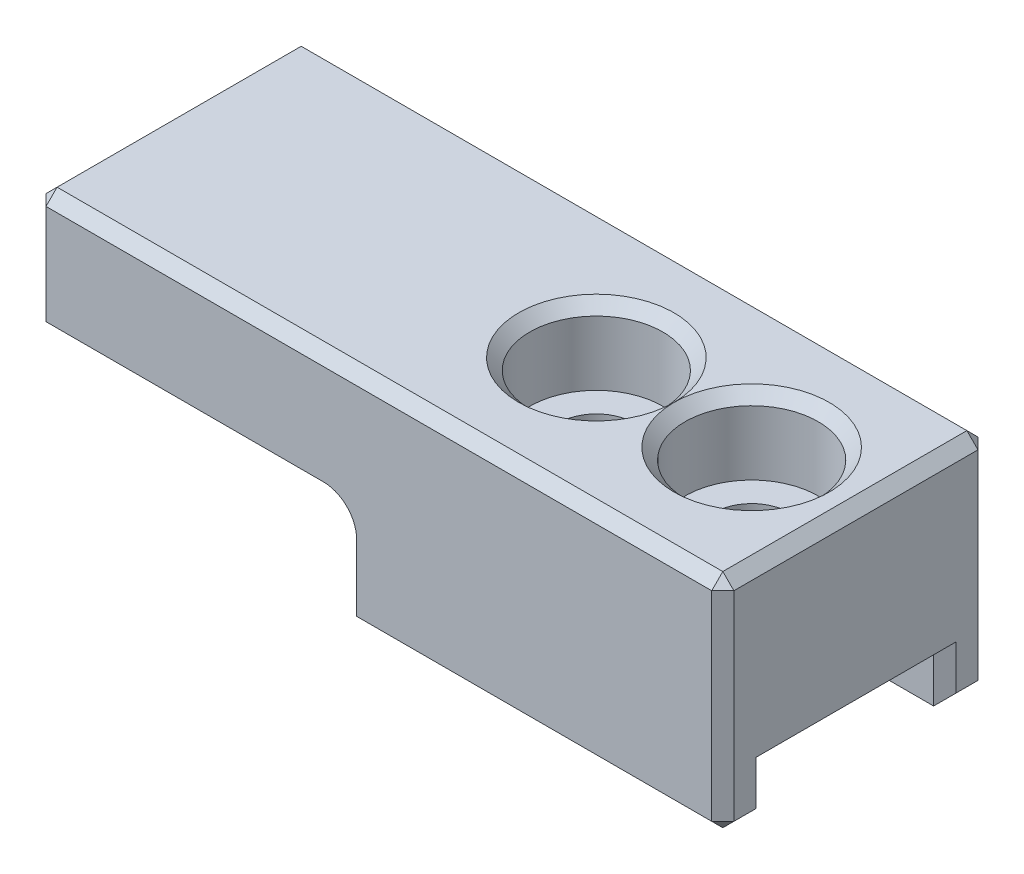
ISO-10303-21;
HEADER;
FILE_DESCRIPTION(('STEP AP214'),'2;1');
FILE_NAME('part.step','',(''),(''),'','','');
FILE_SCHEMA(('AUTOMOTIVE_DESIGN { 1 0 10303 214 1 1 1 1 }'));
ENDSEC;
DATA;
#1=APPLICATION_CONTEXT('core data for automotive mechanical design processes');
#2=APPLICATION_PROTOCOL_DEFINITION('international standard','automotive_design',2000,#1);
#3=PRODUCT_CONTEXT('',#1,'mechanical');
#4=PRODUCT('Part','Part','',(#3));
#5=PRODUCT_RELATED_PRODUCT_CATEGORY('part','',(#4));
#6=PRODUCT_DEFINITION_FORMATION('','',#4);
#7=PRODUCT_DEFINITION_CONTEXT('part definition',#1,'design');
#8=PRODUCT_DEFINITION('design','',#6,#7);
#9=PRODUCT_DEFINITION_SHAPE('','',#8);
#10=(LENGTH_UNIT() NAMED_UNIT(*) SI_UNIT(.MILLI.,.METRE.));
#11=(NAMED_UNIT(*) PLANE_ANGLE_UNIT() SI_UNIT($,.RADIAN.));
#12=(NAMED_UNIT(*) SI_UNIT($,.STERADIAN.) SOLID_ANGLE_UNIT());
#13=UNCERTAINTY_MEASURE_WITH_UNIT(LENGTH_MEASURE(1.E-05),#10,'distance_accuracy_value','');
#14=(GEOMETRIC_REPRESENTATION_CONTEXT(3) GLOBAL_UNCERTAINTY_ASSIGNED_CONTEXT((#13)) GLOBAL_UNIT_ASSIGNED_CONTEXT((#10,
#11,#12)) REPRESENTATION_CONTEXT('',''));
#15=CARTESIAN_POINT('',(0.,0.,0.));
#16=DIRECTION('',(0.,0.,1.));
#17=DIRECTION('',(1.,0.,0.));
#18=AXIS2_PLACEMENT_3D('',#15,#16,#17);
#19=CARTESIAN_POINT('',(-51.8,15.45,-12.));
#20=DIRECTION('',(0.,-1.,0.));
#21=DIRECTION('',(1.,0.,0.));
#22=AXIS2_PLACEMENT_3D('',#19,#20,#21);
#23=PLANE('',#22);
#24=DIRECTION('',(1.,0.,0.));
#25=VECTOR('',#24,1.);
#26=CARTESIAN_POINT('',(-51.8,15.45,-11.5));
#27=LINE('',#26,#25);
#28=CARTESIAN_POINT('',(-68.8,15.45,-11.5));
#29=VERTEX_POINT('',#28);
#30=CARTESIAN_POINT('',(-52.3,15.45,-11.5));
#31=VERTEX_POINT('',#30);
#32=EDGE_CURVE('E276',#29,#31,#27,.T.);
#33=ORIENTED_EDGE('',*,*,#32,.T.);
#34=DIRECTION('',(0.,0.,1.));
#35=VECTOR('',#34,1.);
#36=CARTESIAN_POINT('',(-52.3,15.45,-12.));
#37=LINE('',#36,#35);
#38=CARTESIAN_POINT('',(-52.3,15.45,-10.));
#39=VERTEX_POINT('',#38);
#40=EDGE_CURVE('E278',#31,#39,#37,.T.);
#41=ORIENTED_EDGE('',*,*,#40,.T.);
#42=DIRECTION('',(1.,0.,0.));
#43=VECTOR('',#42,1.);
#44=CARTESIAN_POINT('',(-82.8,15.45,-10.));
#45=LINE('',#44,#43);
#46=CARTESIAN_POINT('',(-68.8,15.45,-10.));
#47=VERTEX_POINT('',#46);
#48=EDGE_CURVE('E439',#47,#39,#45,.T.);
#49=ORIENTED_EDGE('',*,*,#48,.F.);
#50=DIRECTION('',(0.,0.,1.));
#51=VECTOR('',#50,1.);
#52=CARTESIAN_POINT('',(-68.8,15.45,-12.));
#53=LINE('',#52,#51);
#54=EDGE_CURVE('E199',#29,#47,#53,.T.);
#55=ORIENTED_EDGE('',*,*,#54,.F.);
#56=EDGE_LOOP('',(#33,#41,#49,#55));
#57=FACE_BOUND('',#56,.T.);
#58=ADVANCED_FACE('F16',(#57),#23,.T.);
#59=CARTESIAN_POINT('',(-51.8,15.45,-12.));
#60=DIRECTION('',(1.,0.,0.));
#61=DIRECTION('',(0.,0.,-1.));
#62=AXIS2_PLACEMENT_3D('',#59,#60,#61);
#63=PLANE('',#62);
#64=DIRECTION('',(0.,1.,0.));
#65=VECTOR('',#64,1.);
#66=CARTESIAN_POINT('',(-51.8,17.45,-1.5));
#67=LINE('',#66,#65);
#68=CARTESIAN_POINT('',(-51.8,15.95,-1.5));
#69=VERTEX_POINT('',#68);
#70=CARTESIAN_POINT('',(-51.8,17.95,-1.5));
#71=VERTEX_POINT('',#70);
#72=EDGE_CURVE('E264',#69,#71,#67,.T.);
#73=ORIENTED_EDGE('',*,*,#72,.T.);
#74=DIRECTION('',(0.,0.,-1.));
#75=VECTOR('',#74,1.);
#76=CARTESIAN_POINT('',(-51.8,17.95,-10.));
#77=LINE('',#76,#75);
#78=CARTESIAN_POINT('',(-51.8,17.95,-10.5));
#79=VERTEX_POINT('',#78);
#80=EDGE_CURVE('E266',#71,#79,#77,.T.);
#81=ORIENTED_EDGE('',*,*,#80,.T.);
#82=DIRECTION('',(0.,-1.,0.));
#83=VECTOR('',#82,1.);
#84=CARTESIAN_POINT('',(-51.8,15.45,-10.5));
#85=LINE('',#84,#83);
#86=CARTESIAN_POINT('',(-51.8,15.95,-10.5));
#87=VERTEX_POINT('',#86);
#88=EDGE_CURVE('E260',#79,#87,#85,.T.);
#89=ORIENTED_EDGE('',*,*,#88,.T.);
#90=DIRECTION('',(0.,0.,-1.));
#91=VECTOR('',#90,1.);
#92=CARTESIAN_POINT('',(-51.8,15.95,-12.));
#93=LINE('',#92,#91);
#94=CARTESIAN_POINT('',(-51.8,15.95,-11.5));
#95=VERTEX_POINT('',#94);
#96=EDGE_CURVE('E258',#87,#95,#93,.T.);
#97=ORIENTED_EDGE('',*,*,#96,.T.);
#98=DIRECTION('',(0.,1.,0.));
#99=VECTOR('',#98,1.);
#100=CARTESIAN_POINT('',(-51.8,15.45,-11.5));
#101=LINE('',#100,#99);
#102=CARTESIAN_POINT('',(-51.8,24.95,-11.5));
#103=VERTEX_POINT('',#102);
#104=EDGE_CURVE('E256',#95,#103,#101,.T.);
#105=ORIENTED_EDGE('',*,*,#104,.T.);
#106=DIRECTION('',(0.,0.,1.));
#107=VECTOR('',#106,1.);
#108=CARTESIAN_POINT('',(-51.8,24.95,-12.));
#109=LINE('',#108,#107);
#110=CARTESIAN_POINT('',(-51.8,24.95,-0.5));
#111=VERTEX_POINT('',#110);
#112=EDGE_CURVE('E252',#103,#111,#109,.T.);
#113=ORIENTED_EDGE('',*,*,#112,.T.);
#114=DIRECTION('',(0.,-1.,0.));
#115=VECTOR('',#114,1.);
#116=CARTESIAN_POINT('',(-51.8,15.45,-0.5));
#117=LINE('',#116,#115);
#118=CARTESIAN_POINT('',(-51.8,15.95,-0.5));
#119=VERTEX_POINT('',#118);
#120=EDGE_CURVE('E254',#111,#119,#117,.T.);
#121=ORIENTED_EDGE('',*,*,#120,.T.);
#122=DIRECTION('',(0.,0.,-1.));
#123=VECTOR('',#122,1.);
#124=CARTESIAN_POINT('',(-51.8,15.95,-12.));
#125=LINE('',#124,#123);
#126=EDGE_CURVE('E262',#119,#69,#125,.T.);
#127=ORIENTED_EDGE('',*,*,#126,.T.);
#128=EDGE_LOOP('',(#73,#81,#89,#97,#105,#113,#121,#127));
#129=FACE_BOUND('',#128,.T.);
#130=ADVANCED_FACE('F494',(#129),#63,.T.);
#131=DIRECTION('',(1.,0.,0.));
#132=VECTOR('',#131,1.);
#133=CARTESIAN_POINT('',(-82.8,15.45,-2.));
#134=LINE('',#133,#132);
#135=CARTESIAN_POINT('',(-68.8,15.45,-2.));
#136=VERTEX_POINT('',#135);
#137=CARTESIAN_POINT('',(-52.3,15.45,-2.));
#138=VERTEX_POINT('',#137);
#139=EDGE_CURVE('E442',#136,#138,#134,.T.);
#140=ORIENTED_EDGE('',*,*,#139,.T.);
#141=DIRECTION('',(0.,0.,1.));
#142=VECTOR('',#141,1.);
#143=CARTESIAN_POINT('',(-52.3,15.45,-12.));
#144=LINE('',#143,#142);
#145=CARTESIAN_POINT('',(-52.3,15.45,-0.5));
#146=VERTEX_POINT('',#145);
#147=EDGE_CURVE('E273',#138,#146,#144,.T.);
#148=ORIENTED_EDGE('',*,*,#147,.T.);
#149=DIRECTION('',(-1.,0.,0.));
#150=VECTOR('',#149,1.);
#151=CARTESIAN_POINT('',(-68.8,15.45,-0.5));
#152=LINE('',#151,#150);
#153=CARTESIAN_POINT('',(-68.8,15.45,-0.5));
#154=VERTEX_POINT('',#153);
#155=EDGE_CURVE('E271',#146,#154,#152,.T.);
#156=ORIENTED_EDGE('',*,*,#155,.T.);
#157=EDGE_CURVE('E447',#136,#154,#53,.T.);
#158=ORIENTED_EDGE('',*,*,#157,.F.);
#159=EDGE_LOOP('',(#140,#148,#156,#158));
#160=FACE_BOUND('',#159,.T.);
#161=ADVANCED_FACE('F535',(#160),#23,.T.);
#162=CARTESIAN_POINT('',(-68.8,15.45,-12.));
#163=DIRECTION('',(-1.,0.,0.));
#164=DIRECTION('',(0.,0.,1.));
#165=AXIS2_PLACEMENT_3D('',#162,#163,#164);
#166=PLANE('',#165);
#167=DIRECTION('',(0.,0.,1.));
#168=VECTOR('',#167,1.);
#169=CARTESIAN_POINT('',(-68.8,18.95,-12.));
#170=LINE('',#169,#168);
#171=CARTESIAN_POINT('',(-68.8,18.95,-11.5));
#172=VERTEX_POINT('',#171);
#173=CARTESIAN_POINT('',(-68.8,18.95,-0.5));
#174=VERTEX_POINT('',#173);
#175=EDGE_CURVE('E448',#172,#174,#170,.T.);
#176=ORIENTED_EDGE('',*,*,#175,.F.);
#177=DIRECTION('',(0.,-1.,0.));
#178=VECTOR('',#177,1.);
#179=CARTESIAN_POINT('',(-68.8,15.45,-11.5));
#180=LINE('',#179,#178);
#181=EDGE_CURVE('E316',#172,#29,#180,.T.);
#182=ORIENTED_EDGE('',*,*,#181,.T.);
#183=ORIENTED_EDGE('',*,*,#54,.T.);
#184=DIRECTION('',(0.,-1.,0.));
#185=VECTOR('',#184,1.);
#186=CARTESIAN_POINT('',(-68.8,15.45,-10.));
#187=LINE('',#186,#185);
#188=CARTESIAN_POINT('',(-68.8,17.45,-10.));
#189=VERTEX_POINT('',#188);
#190=EDGE_CURVE('E205',#189,#47,#187,.T.);
#191=ORIENTED_EDGE('',*,*,#190,.F.);
#192=DIRECTION('',(0.,0.,-1.));
#193=VECTOR('',#192,1.);
#194=CARTESIAN_POINT('',(-68.8,17.45,-12.));
#195=LINE('',#194,#193);
#196=CARTESIAN_POINT('',(-68.8,17.45,-2.));
#197=VERTEX_POINT('',#196);
#198=EDGE_CURVE('E186',#197,#189,#195,.T.);
#199=ORIENTED_EDGE('',*,*,#198,.F.);
#200=DIRECTION('',(0.,1.,0.));
#201=VECTOR('',#200,1.);
#202=CARTESIAN_POINT('',(-68.8,15.45,-2.));
#203=LINE('',#202,#201);
#204=EDGE_CURVE('E198',#136,#197,#203,.T.);
#205=ORIENTED_EDGE('',*,*,#204,.F.);
#206=ORIENTED_EDGE('',*,*,#157,.T.);
#207=DIRECTION('',(0.,1.,0.));
#208=VECTOR('',#207,1.);
#209=CARTESIAN_POINT('',(-68.8,18.95,-0.5));
#210=LINE('',#209,#208);
#211=EDGE_CURVE('E314',#154,#174,#210,.T.);
#212=ORIENTED_EDGE('',*,*,#211,.T.);
#213=EDGE_LOOP('',(#176,#182,#183,#191,#199,#205,#206,#212));
#214=FACE_BOUND('',#213,.T.);
#215=ADVANCED_FACE('F212',(#214),#166,.T.);
#216=CARTESIAN_POINT('',(-69.8,18.95,-12.));
#217=DIRECTION('',(0.,0.,1.));
#218=DIRECTION('',(1.,0.,0.));
#219=AXIS2_PLACEMENT_3D('',#216,#217,#218);
#220=CYLINDRICAL_SURFACE('',#219,1.);
#221=DIRECTION('',(0.,0.,1.));
#222=VECTOR('',#221,1.);
#223=CARTESIAN_POINT('',(-69.8,19.95,-12.));
#224=LINE('',#223,#222);
#225=CARTESIAN_POINT('',(-69.8,19.95,-11.5));
#226=VERTEX_POINT('',#225);
#227=CARTESIAN_POINT('',(-69.8,19.95,-0.5));
#228=VERTEX_POINT('',#227);
#229=EDGE_CURVE('E441',#226,#228,#224,.T.);
#230=ORIENTED_EDGE('',*,*,#229,.F.);
#231=CARTESIAN_POINT('',(-69.8,18.95,-11.5));
#232=DIRECTION('',(0.,0.,-1.));
#233=DIRECTION('',(-1.,0.,0.));
#234=AXIS2_PLACEMENT_3D('',#231,#232,#233);
#235=CIRCLE('',#234,1.);
#236=EDGE_CURVE('E312',#226,#172,#235,.T.);
#237=ORIENTED_EDGE('',*,*,#236,.T.);
#238=ORIENTED_EDGE('',*,*,#175,.T.);
#239=CARTESIAN_POINT('',(-69.8,18.95,-0.5));
#240=DIRECTION('',(0.,0.,-1.));
#241=DIRECTION('',(-1.,0.,0.));
#242=AXIS2_PLACEMENT_3D('',#239,#240,#241);
#243=CIRCLE('',#242,1.);
#244=EDGE_CURVE('E310',#174,#228,#243,.F.);
#245=ORIENTED_EDGE('',*,*,#244,.T.);
#246=EDGE_LOOP('',(#230,#237,#238,#245));
#247=FACE_BOUND('',#246,.T.);
#248=ADVANCED_FACE('F531',(#247),#220,.F.);
#249=CARTESIAN_POINT('',(-82.8,19.95,-12.));
#250=DIRECTION('',(0.,-1.,0.));
#251=DIRECTION('',(1.,0.,0.));
#252=AXIS2_PLACEMENT_3D('',#249,#250,#251);
#253=PLANE('',#252);
#254=DIRECTION('',(0.,0.,-1.));
#255=VECTOR('',#254,1.);
#256=CARTESIAN_POINT('',(-82.3,19.95,-12.));
#257=LINE('',#256,#255);
#258=CARTESIAN_POINT('',(-82.3,19.95,-0.5));
#259=VERTEX_POINT('',#258);
#260=CARTESIAN_POINT('',(-82.3,19.95,-11.5));
#261=VERTEX_POINT('',#260);
#262=EDGE_CURVE('E291',#259,#261,#257,.T.);
#263=ORIENTED_EDGE('',*,*,#262,.T.);
#264=DIRECTION('',(1.,0.,0.));
#265=VECTOR('',#264,1.);
#266=CARTESIAN_POINT('',(-82.8,19.95,-11.5));
#267=LINE('',#266,#265);
#268=EDGE_CURVE('E293',#261,#226,#267,.T.);
#269=ORIENTED_EDGE('',*,*,#268,.T.);
#270=ORIENTED_EDGE('',*,*,#229,.T.);
#271=DIRECTION('',(-1.,0.,0.));
#272=VECTOR('',#271,1.);
#273=CARTESIAN_POINT('',(-82.8,19.95,-0.5));
#274=LINE('',#273,#272);
#275=EDGE_CURVE('E289',#228,#259,#274,.T.);
#276=ORIENTED_EDGE('',*,*,#275,.T.);
#277=EDGE_LOOP('',(#263,#269,#270,#276));
#278=FACE_BOUND('',#277,.T.);
#279=ADVANCED_FACE('F455',(#278),#253,.T.);
#280=CARTESIAN_POINT('',(-82.8,19.95,-12.));
#281=DIRECTION('',(-1.,0.,0.));
#282=DIRECTION('',(0.,0.,1.));
#283=AXIS2_PLACEMENT_3D('',#280,#281,#282);
#284=PLANE('',#283);
#285=DIRECTION('',(0.,-1.,0.));
#286=VECTOR('',#285,1.);
#287=CARTESIAN_POINT('',(-82.8,19.95,-11.5));
#288=LINE('',#287,#286);
#289=CARTESIAN_POINT('',(-82.8,24.95,-11.5));
#290=VERTEX_POINT('',#289);
#291=CARTESIAN_POINT('',(-82.8,20.45,-11.5));
#292=VERTEX_POINT('',#291);
#293=EDGE_CURVE('E284',#290,#292,#288,.T.);
#294=ORIENTED_EDGE('',*,*,#293,.T.);
#295=DIRECTION('',(0.,0.,1.));
#296=VECTOR('',#295,1.);
#297=CARTESIAN_POINT('',(-82.8,20.45,-12.));
#298=LINE('',#297,#296);
#299=CARTESIAN_POINT('',(-82.8,20.45,-0.5));
#300=VERTEX_POINT('',#299);
#301=EDGE_CURVE('E286',#292,#300,#298,.T.);
#302=ORIENTED_EDGE('',*,*,#301,.T.);
#303=DIRECTION('',(0.,1.,0.));
#304=VECTOR('',#303,1.);
#305=CARTESIAN_POINT('',(-82.8,25.45,-0.5));
#306=LINE('',#305,#304);
#307=CARTESIAN_POINT('',(-82.8,24.95,-0.5));
#308=VERTEX_POINT('',#307);
#309=EDGE_CURVE('E282',#300,#308,#306,.T.);
#310=ORIENTED_EDGE('',*,*,#309,.T.);
#311=DIRECTION('',(0.,0.,-1.));
#312=VECTOR('',#311,1.);
#313=CARTESIAN_POINT('',(-82.8,24.95,-12.));
#314=LINE('',#313,#312);
#315=EDGE_CURVE('E280',#308,#290,#314,.T.);
#316=ORIENTED_EDGE('',*,*,#315,.T.);
#317=EDGE_LOOP('',(#294,#302,#310,#316));
#318=FACE_BOUND('',#317,.T.);
#319=ADVANCED_FACE('F603',(#318),#284,.T.);
#320=CARTESIAN_POINT('',(-51.8,25.45,-12.));
#321=DIRECTION('',(0.,1.,0.));
#322=DIRECTION('',(-1.,0.,0.));
#323=AXIS2_PLACEMENT_3D('',#320,#321,#322);
#324=PLANE('',#323);
#325=CARTESIAN_POINT('',(-63.5,25.45,-6.));
#326=DIRECTION('',(0.,1.,0.));
#327=DIRECTION('',(-1.,0.,0.));
#328=AXIS2_PLACEMENT_3D('',#325,#326,#327);
#329=CIRCLE('',#328,3.5);
#330=CARTESIAN_POINT('',(-60.,25.45,-6.));
#331=VERTEX_POINT('',#330);
#332=CARTESIAN_POINT('',(-63.5,25.45,-2.5));
#333=VERTEX_POINT('',#332);
#334=EDGE_CURVE('E242',#331,#333,#329,.F.);
#335=ORIENTED_EDGE('',*,*,#334,.T.);
#336=CARTESIAN_POINT('',(-63.5,25.45,-6.));
#337=DIRECTION('',(0.,1.,0.));
#338=DIRECTION('',(-1.,0.,0.));
#339=AXIS2_PLACEMENT_3D('',#336,#337,#338);
#340=CIRCLE('',#339,3.5);
#341=EDGE_CURVE('E244',#333,#331,#340,.F.);
#342=ORIENTED_EDGE('',*,*,#341,.T.);
#343=CARTESIAN_POINT('',(-56.5,25.45,-6.));
#344=DIRECTION('',(0.,1.,0.));
#345=DIRECTION('',(-1.,0.,0.));
#346=AXIS2_PLACEMENT_3D('',#343,#344,#345);
#347=CIRCLE('',#346,3.5);
#348=CARTESIAN_POINT('',(-56.5,25.45,-2.5));
#349=VERTEX_POINT('',#348);
#350=EDGE_CURVE('E237',#331,#349,#347,.F.);
#351=ORIENTED_EDGE('',*,*,#350,.T.);
#352=CARTESIAN_POINT('',(-56.5,25.45,-6.));
#353=DIRECTION('',(0.,1.,0.));
#354=DIRECTION('',(-1.,0.,0.));
#355=AXIS2_PLACEMENT_3D('',#352,#353,#354);
#356=CIRCLE('',#355,3.5);
#357=EDGE_CURVE('E239',#349,#331,#356,.F.);
#358=ORIENTED_EDGE('',*,*,#357,.T.);
#359=EDGE_LOOP('',(#335,#342,#351,#358));
#360=FACE_BOUND('',#359,.T.);
#361=DIRECTION('',(-1.,0.,0.));
#362=VECTOR('',#361,1.);
#363=CARTESIAN_POINT('',(-51.8,25.45,-11.5));
#364=LINE('',#363,#362);
#365=CARTESIAN_POINT('',(-52.3,25.45,-11.5));
#366=VERTEX_POINT('',#365);
#367=CARTESIAN_POINT('',(-82.3,25.45,-11.5));
#368=VERTEX_POINT('',#367);
#369=EDGE_CURVE('E232',#366,#368,#364,.T.);
#370=ORIENTED_EDGE('',*,*,#369,.T.);
#371=DIRECTION('',(0.,0.,1.));
#372=VECTOR('',#371,1.);
#373=CARTESIAN_POINT('',(-82.3,25.45,-12.));
#374=LINE('',#373,#372);
#375=CARTESIAN_POINT('',(-82.3,25.45,-0.5));
#376=VERTEX_POINT('',#375);
#377=EDGE_CURVE('E234',#368,#376,#374,.T.);
#378=ORIENTED_EDGE('',*,*,#377,.T.);
#379=DIRECTION('',(1.,0.,0.));
#380=VECTOR('',#379,1.);
#381=CARTESIAN_POINT('',(-51.8,25.45,-0.5));
#382=LINE('',#381,#380);
#383=CARTESIAN_POINT('',(-52.3,25.45,-0.5));
#384=VERTEX_POINT('',#383);
#385=EDGE_CURVE('E230',#376,#384,#382,.T.);
#386=ORIENTED_EDGE('',*,*,#385,.T.);
#387=DIRECTION('',(0.,0.,-1.));
#388=VECTOR('',#387,1.);
#389=CARTESIAN_POINT('',(-52.3,25.45,-12.));
#390=LINE('',#389,#388);
#391=EDGE_CURVE('E217',#384,#366,#390,.T.);
#392=ORIENTED_EDGE('',*,*,#391,.T.);
#393=EDGE_LOOP('',(#370,#378,#386,#392));
#394=FACE_BOUND('',#393,.T.);
#395=ADVANCED_FACE('F505',(#360,#394),#324,.T.);
#396=CARTESIAN_POINT('',(-69.8,18.95,-12.));
#397=DIRECTION('',(0.,0.,-1.));
#398=DIRECTION('',(-1.,0.,0.));
#399=AXIS2_PLACEMENT_3D('',#396,#397,#398);
#400=PLANE('',#399);
#401=DIRECTION('',(-1.,0.,0.));
#402=VECTOR('',#401,1.);
#403=CARTESIAN_POINT('',(-69.8,20.45,-12.));
#404=LINE('',#403,#402);
#405=CARTESIAN_POINT('',(-69.8,20.45,-12.));
#406=VERTEX_POINT('',#405);
#407=CARTESIAN_POINT('',(-82.3,20.45,-12.));
#408=VERTEX_POINT('',#407);
#409=EDGE_CURVE('E305',#406,#408,#404,.T.);
#410=ORIENTED_EDGE('',*,*,#409,.T.);
#411=DIRECTION('',(0.,1.,0.));
#412=VECTOR('',#411,1.);
#413=CARTESIAN_POINT('',(-82.3,18.95,-12.));
#414=LINE('',#413,#412);
#415=CARTESIAN_POINT('',(-82.3,24.95,-12.));
#416=VERTEX_POINT('',#415);
#417=EDGE_CURVE('E307',#408,#416,#414,.T.);
#418=ORIENTED_EDGE('',*,*,#417,.T.);
#419=DIRECTION('',(1.,0.,0.));
#420=VECTOR('',#419,1.);
#421=CARTESIAN_POINT('',(-69.8,24.95,-12.));
#422=LINE('',#421,#420);
#423=CARTESIAN_POINT('',(-52.3,24.95,-12.));
#424=VERTEX_POINT('',#423);
#425=EDGE_CURVE('E295',#416,#424,#422,.T.);
#426=ORIENTED_EDGE('',*,*,#425,.T.);
#427=DIRECTION('',(0.,-1.,0.));
#428=VECTOR('',#427,1.);
#429=CARTESIAN_POINT('',(-52.3,18.95,-12.));
#430=LINE('',#429,#428);
#431=CARTESIAN_POINT('',(-52.3,15.95,-12.));
#432=VERTEX_POINT('',#431);
#433=EDGE_CURVE('E297',#424,#432,#430,.T.);
#434=ORIENTED_EDGE('',*,*,#433,.T.);
#435=DIRECTION('',(-1.,0.,0.));
#436=VECTOR('',#435,1.);
#437=CARTESIAN_POINT('',(-69.8,15.95,-12.));
#438=LINE('',#437,#436);
#439=CARTESIAN_POINT('',(-68.3,15.95,-12.));
#440=VERTEX_POINT('',#439);
#441=EDGE_CURVE('E299',#432,#440,#438,.T.);
#442=ORIENTED_EDGE('',*,*,#441,.T.);
#443=DIRECTION('',(0.,1.,0.));
#444=VECTOR('',#443,1.);
#445=CARTESIAN_POINT('',(-68.3,18.95,-12.));
#446=LINE('',#445,#444);
#447=CARTESIAN_POINT('',(-68.3,18.95,-12.));
#448=VERTEX_POINT('',#447);
#449=EDGE_CURVE('E301',#440,#448,#446,.T.);
#450=ORIENTED_EDGE('',*,*,#449,.T.);
#451=CARTESIAN_POINT('',(-69.8,18.95,-12.));
#452=DIRECTION('',(0.,0.,-1.));
#453=DIRECTION('',(-1.,0.,0.));
#454=AXIS2_PLACEMENT_3D('',#451,#452,#453);
#455=CIRCLE('',#454,1.5);
#456=EDGE_CURVE('E303',#448,#406,#455,.F.);
#457=ORIENTED_EDGE('',*,*,#456,.T.);
#458=EDGE_LOOP('',(#410,#418,#426,#434,#442,#450,#457));
#459=FACE_BOUND('',#458,.T.);
#460=ADVANCED_FACE('F521',(#459),#400,.T.);
#461=CARTESIAN_POINT('',(-69.8,18.95,0.));
#462=DIRECTION('',(0.,0.,-1.));
#463=DIRECTION('',(-1.,0.,0.));
#464=AXIS2_PLACEMENT_3D('',#461,#462,#463);
#465=PLANE('',#464);
#466=DIRECTION('',(0.,-1.,0.));
#467=VECTOR('',#466,1.);
#468=CARTESIAN_POINT('',(-68.3,15.45,0.));
#469=LINE('',#468,#467);
#470=CARTESIAN_POINT('',(-68.3,18.95,0.));
#471=VERTEX_POINT('',#470);
#472=CARTESIAN_POINT('',(-68.3,15.95,0.));
#473=VERTEX_POINT('',#472);
#474=EDGE_CURVE('E25',#471,#473,#469,.T.);
#475=ORIENTED_EDGE('',*,*,#474,.T.);
#476=DIRECTION('',(1.,0.,0.));
#477=VECTOR('',#476,1.);
#478=CARTESIAN_POINT('',(-51.8,15.95,0.));
#479=LINE('',#478,#477);
#480=CARTESIAN_POINT('',(-52.3,15.95,0.));
#481=VERTEX_POINT('',#480);
#482=EDGE_CURVE('E11',#473,#481,#479,.T.);
#483=ORIENTED_EDGE('',*,*,#482,.T.);
#484=DIRECTION('',(0.,1.,0.));
#485=VECTOR('',#484,1.);
#486=CARTESIAN_POINT('',(-52.3,25.45,0.));
#487=LINE('',#486,#485);
#488=CARTESIAN_POINT('',(-52.3,24.95,0.));
#489=VERTEX_POINT('',#488);
#490=EDGE_CURVE('E320',#481,#489,#487,.T.);
#491=ORIENTED_EDGE('',*,*,#490,.T.);
#492=DIRECTION('',(-1.,0.,0.));
#493=VECTOR('',#492,1.);
#494=CARTESIAN_POINT('',(-82.8,24.95,0.));
#495=LINE('',#494,#493);
#496=CARTESIAN_POINT('',(-82.3,24.95,0.));
#497=VERTEX_POINT('',#496);
#498=EDGE_CURVE('E318',#489,#497,#495,.T.);
#499=ORIENTED_EDGE('',*,*,#498,.T.);
#500=DIRECTION('',(0.,-1.,0.));
#501=VECTOR('',#500,1.);
#502=CARTESIAN_POINT('',(-82.3,19.95,0.));
#503=LINE('',#502,#501);
#504=CARTESIAN_POINT('',(-82.3,20.45,0.));
#505=VERTEX_POINT('',#504);
#506=EDGE_CURVE('E322',#497,#505,#503,.T.);
#507=ORIENTED_EDGE('',*,*,#506,.T.);
#508=DIRECTION('',(1.,0.,0.));
#509=VECTOR('',#508,1.);
#510=CARTESIAN_POINT('',(-69.8,20.45,0.));
#511=LINE('',#510,#509);
#512=CARTESIAN_POINT('',(-69.8,20.45,0.));
#513=VERTEX_POINT('',#512);
#514=EDGE_CURVE('E324',#505,#513,#511,.T.);
#515=ORIENTED_EDGE('',*,*,#514,.T.);
#516=CARTESIAN_POINT('',(-69.8,18.95,0.));
#517=DIRECTION('',(0.,0.,-1.));
#518=DIRECTION('',(-1.,0.,0.));
#519=AXIS2_PLACEMENT_3D('',#516,#517,#518);
#520=CIRCLE('',#519,1.5);
#521=EDGE_CURVE('E36',#513,#471,#520,.T.);
#522=ORIENTED_EDGE('',*,*,#521,.T.);
#523=EDGE_LOOP('',(#475,#483,#491,#499,#507,#515,#522));
#524=FACE_BOUND('',#523,.T.);
#525=ADVANCED_FACE('F477',(#524),#465,.F.);
#526=CARTESIAN_POINT('',(-82.8,15.45,-10.));
#527=DIRECTION('',(0.,0.,-1.));
#528=DIRECTION('',(-1.,0.,0.));
#529=AXIS2_PLACEMENT_3D('',#526,#527,#528);
#530=PLANE('',#529);
#531=ORIENTED_EDGE('',*,*,#48,.T.);
#532=DIRECTION('',(0.,1.,0.));
#533=VECTOR('',#532,1.);
#534=CARTESIAN_POINT('',(-52.3,17.45,-10.));
#535=LINE('',#534,#533);
#536=CARTESIAN_POINT('',(-52.3,17.45,-10.));
#537=VERTEX_POINT('',#536);
#538=EDGE_CURVE('E208',#39,#537,#535,.T.);
#539=ORIENTED_EDGE('',*,*,#538,.T.);
#540=DIRECTION('',(1.,0.,0.));
#541=VECTOR('',#540,1.);
#542=CARTESIAN_POINT('',(-82.8,17.45,-10.));
#543=LINE('',#542,#541);
#544=EDGE_CURVE('E190',#189,#537,#543,.T.);
#545=ORIENTED_EDGE('',*,*,#544,.F.);
#546=ORIENTED_EDGE('',*,*,#190,.T.);
#547=EDGE_LOOP('',(#531,#539,#545,#546));
#548=FACE_BOUND('',#547,.T.);
#549=ADVANCED_FACE('F204',(#548),#530,.F.);
#550=CARTESIAN_POINT('',(-82.8,15.45,-2.));
#551=DIRECTION('',(0.,0.,1.));
#552=DIRECTION('',(1.,0.,0.));
#553=AXIS2_PLACEMENT_3D('',#550,#551,#552);
#554=PLANE('',#553);
#555=DIRECTION('',(1.,0.,0.));
#556=VECTOR('',#555,1.);
#557=CARTESIAN_POINT('',(-82.8,17.45,-2.));
#558=LINE('',#557,#556);
#559=CARTESIAN_POINT('',(-52.3,17.45,-2.));
#560=VERTEX_POINT('',#559);
#561=EDGE_CURVE('E193',#197,#560,#558,.T.);
#562=ORIENTED_EDGE('',*,*,#561,.T.);
#563=DIRECTION('',(0.,-1.,0.));
#564=VECTOR('',#563,1.);
#565=CARTESIAN_POINT('',(-52.3,15.45,-2.));
#566=LINE('',#565,#564);
#567=EDGE_CURVE('E269',#560,#138,#566,.T.);
#568=ORIENTED_EDGE('',*,*,#567,.T.);
#569=ORIENTED_EDGE('',*,*,#139,.F.);
#570=ORIENTED_EDGE('',*,*,#204,.T.);
#571=EDGE_LOOP('',(#562,#568,#569,#570));
#572=FACE_BOUND('',#571,.T.);
#573=ADVANCED_FACE('F884',(#572),#554,.F.);
#574=CARTESIAN_POINT('',(-82.8,17.45,-10.));
#575=DIRECTION('',(0.,1.,0.));
#576=DIRECTION('',(0.,0.,1.));
#577=AXIS2_PLACEMENT_3D('',#574,#575,#576);
#578=PLANE('',#577);
#579=CARTESIAN_POINT('',(-56.5,17.45,-6.));
#580=DIRECTION('',(0.,1.,0.));
#581=DIRECTION('',(0.,0.,1.));
#582=AXIS2_PLACEMENT_3D('',#579,#580,#581);
#583=CIRCLE('',#582,1.7);
#584=CARTESIAN_POINT('',(-56.5,17.45,-4.3));
#585=VERTEX_POINT('',#584);
#586=EDGE_CURVE('E224',#585,#585,#583,.T.);
#587=ORIENTED_EDGE('',*,*,#586,.T.);
#588=EDGE_LOOP('',(#587));
#589=FACE_BOUND('',#588,.T.);
#590=CARTESIAN_POINT('',(-63.5,17.45,-6.));
#591=DIRECTION('',(0.,1.,0.));
#592=DIRECTION('',(0.,0.,1.));
#593=AXIS2_PLACEMENT_3D('',#590,#591,#592);
#594=CIRCLE('',#593,1.7);
#595=CARTESIAN_POINT('',(-63.5,17.45,-4.3));
#596=VERTEX_POINT('',#595);
#597=EDGE_CURVE('E209',#596,#596,#594,.T.);
#598=ORIENTED_EDGE('',*,*,#597,.T.);
#599=EDGE_LOOP('',(#598));
#600=FACE_BOUND('',#599,.T.);
#601=ORIENTED_EDGE('',*,*,#544,.T.);
#602=DIRECTION('',(0.,0.,1.));
#603=VECTOR('',#602,1.);
#604=CARTESIAN_POINT('',(-52.3,17.45,-2.));
#605=LINE('',#604,#603);
#606=EDGE_CURVE('E250',#537,#560,#605,.T.);
#607=ORIENTED_EDGE('',*,*,#606,.T.);
#608=ORIENTED_EDGE('',*,*,#561,.F.);
#609=ORIENTED_EDGE('',*,*,#198,.T.);
#610=EDGE_LOOP('',(#601,#607,#608,#609));
#611=FACE_BOUND('',#610,.T.);
#612=ADVANCED_FACE('F188',(#589,#600,#611),#578,.F.);
#613=CARTESIAN_POINT('',(-63.5,25.45,-6.));
#614=DIRECTION('',(0.,1.,0.));
#615=DIRECTION('',(0.,0.,1.));
#616=AXIS2_PLACEMENT_3D('',#613,#614,#615);
#617=CYLINDRICAL_SURFACE('',#616,1.7);
#618=CARTESIAN_POINT('',(-63.5,22.05,-6.));
#619=DIRECTION('',(0.,1.,0.));
#620=DIRECTION('',(0.,0.,1.));
#621=AXIS2_PLACEMENT_3D('',#618,#619,#620);
#622=CIRCLE('',#621,1.7);
#623=CARTESIAN_POINT('',(-63.5,22.05,-4.3));
#624=VERTEX_POINT('',#623);
#625=EDGE_CURVE('E223',#624,#624,#622,.T.);
#626=ORIENTED_EDGE('',*,*,#625,.T.);
#627=EDGE_LOOP('',(#626));
#628=FACE_BOUND('',#627,.T.);
#629=ORIENTED_EDGE('',*,*,#597,.F.);
#630=EDGE_LOOP('',(#629));
#631=FACE_BOUND('',#630,.T.);
#632=ADVANCED_FACE('F869',(#628,#631),#617,.F.);
#633=CARTESIAN_POINT('',(-61.8,22.05,-6.));
#634=DIRECTION('',(0.,-1.,0.));
#635=DIRECTION('',(0.,0.,-1.));
#636=AXIS2_PLACEMENT_3D('',#633,#634,#635);
#637=PLANE('',#636);
#638=ORIENTED_EDGE('',*,*,#625,.F.);
#639=EDGE_LOOP('',(#638));
#640=FACE_BOUND('',#639,.T.);
#641=CARTESIAN_POINT('',(-63.5,22.05,-6.));
#642=DIRECTION('',(0.,1.,0.));
#643=DIRECTION('',(0.,0.,1.));
#644=AXIS2_PLACEMENT_3D('',#641,#642,#643);
#645=CIRCLE('',#644,3.);
#646=CARTESIAN_POINT('',(-63.5,22.05,-3.));
#647=VERTEX_POINT('',#646);
#648=EDGE_CURVE('E226',#647,#647,#645,.T.);
#649=ORIENTED_EDGE('',*,*,#648,.T.);
#650=EDGE_LOOP('',(#649));
#651=FACE_BOUND('',#650,.T.);
#652=ADVANCED_FACE('F861',(#640,#651),#637,.F.);
#653=CARTESIAN_POINT('',(-63.5,25.45,-6.));
#654=DIRECTION('',(0.,1.,0.));
#655=DIRECTION('',(0.,0.,1.));
#656=AXIS2_PLACEMENT_3D('',#653,#654,#655);
#657=CYLINDRICAL_SURFACE('',#656,3.);
#658=CARTESIAN_POINT('',(-63.5,24.95,-6.));
#659=DIRECTION('',(0.,1.,0.));
#660=DIRECTION('',(0.,0.,1.));
#661=AXIS2_PLACEMENT_3D('',#658,#659,#660);
#662=CIRCLE('',#661,3.);
#663=CARTESIAN_POINT('',(-63.5,24.95,-3.));
#664=VERTEX_POINT('',#663);
#665=EDGE_CURVE('E214',#664,#664,#662,.T.);
#666=ORIENTED_EDGE('',*,*,#665,.T.);
#667=EDGE_LOOP('',(#666));
#668=FACE_BOUND('',#667,.T.);
#669=ORIENTED_EDGE('',*,*,#648,.F.);
#670=EDGE_LOOP('',(#669));
#671=FACE_BOUND('',#670,.T.);
#672=ADVANCED_FACE('F853',(#668,#671),#657,.F.);
#673=CARTESIAN_POINT('',(-56.5,25.45,-6.));
#674=DIRECTION('',(0.,1.,0.));
#675=DIRECTION('',(0.,0.,1.));
#676=AXIS2_PLACEMENT_3D('',#673,#674,#675);
#677=CYLINDRICAL_SURFACE('',#676,1.7);
#678=CARTESIAN_POINT('',(-56.5,22.05,-6.));
#679=DIRECTION('',(0.,1.,0.));
#680=DIRECTION('',(0.,0.,1.));
#681=AXIS2_PLACEMENT_3D('',#678,#679,#680);
#682=CIRCLE('',#681,1.7);
#683=CARTESIAN_POINT('',(-56.5,22.05,-4.3));
#684=VERTEX_POINT('',#683);
#685=EDGE_CURVE('E227',#684,#684,#682,.T.);
#686=ORIENTED_EDGE('',*,*,#685,.T.);
#687=EDGE_LOOP('',(#686));
#688=FACE_BOUND('',#687,.T.);
#689=ORIENTED_EDGE('',*,*,#586,.F.);
#690=EDGE_LOOP('',(#689));
#691=FACE_BOUND('',#690,.T.);
#692=ADVANCED_FACE('F845',(#688,#691),#677,.F.);
#693=CARTESIAN_POINT('',(-54.8,22.05,-6.));
#694=DIRECTION('',(0.,-1.,0.));
#695=DIRECTION('',(0.,0.,-1.));
#696=AXIS2_PLACEMENT_3D('',#693,#694,#695);
#697=PLANE('',#696);
#698=ORIENTED_EDGE('',*,*,#685,.F.);
#699=EDGE_LOOP('',(#698));
#700=FACE_BOUND('',#699,.T.);
#701=CARTESIAN_POINT('',(-56.5,22.05,-6.));
#702=DIRECTION('',(0.,1.,0.));
#703=DIRECTION('',(0.,0.,1.));
#704=AXIS2_PLACEMENT_3D('',#701,#702,#703);
#705=CIRCLE('',#704,3.);
#706=CARTESIAN_POINT('',(-56.5,22.05,-3.));
#707=VERTEX_POINT('',#706);
#708=EDGE_CURVE('E426',#707,#707,#705,.T.);
#709=ORIENTED_EDGE('',*,*,#708,.T.);
#710=EDGE_LOOP('',(#709));
#711=FACE_BOUND('',#710,.T.);
#712=ADVANCED_FACE('F836',(#700,#711),#697,.F.);
#713=CARTESIAN_POINT('',(-56.5,25.45,-6.));
#714=DIRECTION('',(0.,1.,0.));
#715=DIRECTION('',(0.,0.,1.));
#716=AXIS2_PLACEMENT_3D('',#713,#714,#715);
#717=CYLINDRICAL_SURFACE('',#716,3.);
#718=CARTESIAN_POINT('',(-56.5,24.95,-6.));
#719=DIRECTION('',(0.,1.,0.));
#720=DIRECTION('',(0.,0.,1.));
#721=AXIS2_PLACEMENT_3D('',#718,#719,#720);
#722=CIRCLE('',#721,3.);
#723=CARTESIAN_POINT('',(-56.5,24.95,-3.));
#724=VERTEX_POINT('',#723);
#725=EDGE_CURVE('E247',#724,#724,#722,.T.);
#726=ORIENTED_EDGE('',*,*,#725,.T.);
#727=EDGE_LOOP('',(#726));
#728=FACE_BOUND('',#727,.T.);
#729=ORIENTED_EDGE('',*,*,#708,.F.);
#730=EDGE_LOOP('',(#729));
#731=FACE_BOUND('',#730,.T.);
#732=ADVANCED_FACE('F614',(#728,#731),#717,.F.);
#733=CARTESIAN_POINT('',(-63.5,24.95,-6.));
#734=DIRECTION('',(0.,1.,0.));
#735=DIRECTION('',(0.,0.,1.));
#736=AXIS2_PLACEMENT_3D('',#733,#734,#735);
#737=CONICAL_SURFACE('',#736,3.,0.785398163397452);
#738=ORIENTED_EDGE('',*,*,#334,.F.);
#739=ORIENTED_EDGE('',*,*,#341,.F.);
#740=EDGE_LOOP('',(#738,#739));
#741=FACE_BOUND('',#740,.T.);
#742=ORIENTED_EDGE('',*,*,#665,.F.);
#743=EDGE_LOOP('',(#742));
#744=FACE_BOUND('',#743,.T.);
#745=ADVANCED_FACE('F610',(#741,#744),#737,.F.);
#746=CARTESIAN_POINT('',(-56.5,24.95,-6.));
#747=DIRECTION('',(0.,1.,0.));
#748=DIRECTION('',(0.,0.,1.));
#749=AXIS2_PLACEMENT_3D('',#746,#747,#748);
#750=CONICAL_SURFACE('',#749,3.,0.785398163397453);
#751=ORIENTED_EDGE('',*,*,#350,.F.);
#752=ORIENTED_EDGE('',*,*,#357,.F.);
#753=EDGE_LOOP('',(#751,#752));
#754=FACE_BOUND('',#753,.T.);
#755=ORIENTED_EDGE('',*,*,#725,.F.);
#756=EDGE_LOOP('',(#755));
#757=FACE_BOUND('',#756,.T.);
#758=ADVANCED_FACE('F613',(#754,#757),#750,.F.);
#759=CARTESIAN_POINT('',(-82.8,20.45,-12.));
#760=DIRECTION('',(0.707106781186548,0.707106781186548,0.));
#761=DIRECTION('',(0.,0.,1.));
#762=AXIS2_PLACEMENT_3D('',#759,#760,#761);
#763=PLANE('',#762);
#764=DIRECTION('',(-0.707106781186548,0.707106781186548,0.));
#765=VECTOR('',#764,1.);
#766=CARTESIAN_POINT('',(-82.8,20.45,-0.5));
#767=LINE('',#766,#765);
#768=EDGE_CURVE('E418',#300,#259,#767,.F.);
#769=ORIENTED_EDGE('',*,*,#768,.F.);
#770=ORIENTED_EDGE('',*,*,#301,.F.);
#771=DIRECTION('',(0.707106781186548,-0.707106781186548,0.));
#772=VECTOR('',#771,1.);
#773=CARTESIAN_POINT('',(-82.3,19.95,-11.5));
#774=LINE('',#773,#772);
#775=EDGE_CURVE('E420',#261,#292,#774,.F.);
#776=ORIENTED_EDGE('',*,*,#775,.F.);
#777=ORIENTED_EDGE('',*,*,#262,.F.);
#778=EDGE_LOOP('',(#769,#770,#776,#777));
#779=FACE_BOUND('',#778,.T.);
#780=ADVANCED_FACE('F18',(#779),#763,.F.);
#781=CARTESIAN_POINT('',(-82.8,19.95,-11.5));
#782=DIRECTION('',(0.707106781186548,0.,0.707106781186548));
#783=DIRECTION('',(0.,-1.,0.));
#784=AXIS2_PLACEMENT_3D('',#781,#782,#783);
#785=PLANE('',#784);
#786=DIRECTION('',(-0.707106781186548,0.,0.707106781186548));
#787=VECTOR('',#786,1.);
#788=CARTESIAN_POINT('',(-82.55,20.45,-11.75));
#789=LINE('',#788,#787);
#790=EDGE_CURVE('E20',#292,#408,#789,.F.);
#791=ORIENTED_EDGE('',*,*,#790,.F.);
#792=ORIENTED_EDGE('',*,*,#293,.F.);
#793=DIRECTION('',(0.707106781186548,0.,-0.707106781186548));
#794=VECTOR('',#793,1.);
#795=CARTESIAN_POINT('',(-82.3,24.95,-12.));
#796=LINE('',#795,#794);
#797=EDGE_CURVE('E409',#416,#290,#796,.F.);
#798=ORIENTED_EDGE('',*,*,#797,.F.);
#799=ORIENTED_EDGE('',*,*,#417,.F.);
#800=EDGE_LOOP('',(#791,#792,#798,#799));
#801=FACE_BOUND('',#800,.T.);
#802=ADVANCED_FACE('F519',(#801),#785,.F.);
#803=CARTESIAN_POINT('',(-82.3,19.95,-11.5));
#804=DIRECTION('',(-0.577350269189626,-0.577350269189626,-0.577350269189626));
#805=DIRECTION('',(-0.707106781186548,0.,0.707106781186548));
#806=AXIS2_PLACEMENT_3D('',#803,#804,#805);
#807=PLANE('',#806);
#808=ORIENTED_EDGE('',*,*,#775,.T.);
#809=ORIENTED_EDGE('',*,*,#790,.T.);
#810=DIRECTION('',(0.,0.707106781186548,-0.707106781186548));
#811=VECTOR('',#810,1.);
#812=CARTESIAN_POINT('',(-82.3,19.95,-11.5));
#813=LINE('',#812,#811);
#814=EDGE_CURVE('E406',#261,#408,#813,.T.);
#815=ORIENTED_EDGE('',*,*,#814,.F.);
#816=EDGE_LOOP('',(#808,#809,#815));
#817=FACE_BOUND('',#816,.T.);
#818=ADVANCED_FACE('F811',(#817),#807,.T.);
#819=CARTESIAN_POINT('',(-82.8,20.45,-0.5));
#820=DIRECTION('',(-0.577350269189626,-0.577350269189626,0.577350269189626));
#821=DIRECTION('',(0.707106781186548,0.,0.707106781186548));
#822=AXIS2_PLACEMENT_3D('',#819,#820,#821);
#823=PLANE('',#822);
#824=DIRECTION('',(0.,0.707106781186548,0.707106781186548));
#825=VECTOR('',#824,1.);
#826=CARTESIAN_POINT('',(-82.3,20.2,-0.25));
#827=LINE('',#826,#825);
#828=EDGE_CURVE('E403',#505,#259,#827,.F.);
#829=ORIENTED_EDGE('',*,*,#828,.F.);
#830=DIRECTION('',(-0.707106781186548,0.,-0.707106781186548));
#831=VECTOR('',#830,1.);
#832=CARTESIAN_POINT('',(-82.8,20.45,-0.5));
#833=LINE('',#832,#831);
#834=EDGE_CURVE('E415',#300,#505,#833,.F.);
#835=ORIENTED_EDGE('',*,*,#834,.F.);
#836=ORIENTED_EDGE('',*,*,#768,.T.);
#837=EDGE_LOOP('',(#829,#835,#836));
#838=FACE_BOUND('',#837,.T.);
#839=ADVANCED_FACE('F803',(#838),#823,.T.);
#840=CARTESIAN_POINT('',(-82.3,18.95,0.));
#841=DIRECTION('',(-0.707106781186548,0.,0.707106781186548));
#842=DIRECTION('',(0.,1.,0.));
#843=AXIS2_PLACEMENT_3D('',#840,#841,#842);
#844=PLANE('',#843);
#845=ORIENTED_EDGE('',*,*,#834,.T.);
#846=ORIENTED_EDGE('',*,*,#506,.F.);
#847=DIRECTION('',(0.707106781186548,0.,0.707106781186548));
#848=VECTOR('',#847,1.);
#849=CARTESIAN_POINT('',(-82.8,24.95,-0.5));
#850=LINE('',#849,#848);
#851=EDGE_CURVE('E400',#308,#497,#850,.T.);
#852=ORIENTED_EDGE('',*,*,#851,.F.);
#853=ORIENTED_EDGE('',*,*,#309,.F.);
#854=EDGE_LOOP('',(#845,#846,#852,#853));
#855=FACE_BOUND('',#854,.T.);
#856=ADVANCED_FACE('F795',(#855),#844,.T.);
#857=CARTESIAN_POINT('',(-82.3,25.45,-12.));
#858=DIRECTION('',(0.707106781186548,-0.707106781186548,0.));
#859=DIRECTION('',(0.,0.,1.));
#860=AXIS2_PLACEMENT_3D('',#857,#858,#859);
#861=PLANE('',#860);
#862=DIRECTION('',(-0.707106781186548,-0.707106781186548,0.));
#863=VECTOR('',#862,1.);
#864=CARTESIAN_POINT('',(-82.55,25.2,-11.5));
#865=LINE('',#864,#863);
#866=EDGE_CURVE('E412',#290,#368,#865,.F.);
#867=ORIENTED_EDGE('',*,*,#866,.F.);
#868=ORIENTED_EDGE('',*,*,#315,.F.);
#869=DIRECTION('',(0.707106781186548,0.707106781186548,0.));
#870=VECTOR('',#869,1.);
#871=CARTESIAN_POINT('',(-82.8,24.95,-0.5));
#872=LINE('',#871,#870);
#873=EDGE_CURVE('E397',#376,#308,#872,.F.);
#874=ORIENTED_EDGE('',*,*,#873,.F.);
#875=ORIENTED_EDGE('',*,*,#377,.F.);
#876=EDGE_LOOP('',(#867,#868,#874,#875));
#877=FACE_BOUND('',#876,.T.);
#878=ADVANCED_FACE('F788',(#877),#861,.F.);
#879=CARTESIAN_POINT('',(-82.3,24.95,-12.));
#880=DIRECTION('',(-0.577350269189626,0.577350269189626,-0.577350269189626));
#881=DIRECTION('',(-0.707106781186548,0.,0.707106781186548));
#882=AXIS2_PLACEMENT_3D('',#879,#880,#881);
#883=PLANE('',#882);
#884=ORIENTED_EDGE('',*,*,#797,.T.);
#885=ORIENTED_EDGE('',*,*,#866,.T.);
#886=DIRECTION('',(0.,0.707106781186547,0.707106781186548));
#887=VECTOR('',#886,1.);
#888=CARTESIAN_POINT('',(-82.3,24.95,-12.));
#889=LINE('',#888,#887);
#890=EDGE_CURVE('E394',#416,#368,#889,.T.);
#891=ORIENTED_EDGE('',*,*,#890,.F.);
#892=EDGE_LOOP('',(#884,#885,#891));
#893=FACE_BOUND('',#892,.T.);
#894=ADVANCED_FACE('F514',(#893),#883,.T.);
#895=CARTESIAN_POINT('',(-82.8,19.95,-11.5));
#896=DIRECTION('',(0.,0.707106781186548,0.707106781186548));
#897=DIRECTION('',(1.,0.,0.));
#898=AXIS2_PLACEMENT_3D('',#895,#896,#897);
#899=PLANE('',#898);
#900=ORIENTED_EDGE('',*,*,#814,.T.);
#901=ORIENTED_EDGE('',*,*,#409,.F.);
#902=DIRECTION('',(0.,0.707106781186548,-0.707106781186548));
#903=VECTOR('',#902,1.);
#904=CARTESIAN_POINT('',(-69.8,19.95,-11.5));
#905=LINE('',#904,#903);
#906=EDGE_CURVE('E391',#226,#406,#905,.T.);
#907=ORIENTED_EDGE('',*,*,#906,.F.);
#908=ORIENTED_EDGE('',*,*,#268,.F.);
#909=EDGE_LOOP('',(#900,#901,#907,#908));
#910=FACE_BOUND('',#909,.T.);
#911=ADVANCED_FACE('F525',(#910),#899,.F.);
#912=CARTESIAN_POINT('',(-69.8,20.45,0.));
#913=DIRECTION('',(0.,-0.707106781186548,0.707106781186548));
#914=DIRECTION('',(-1.,0.,0.));
#915=AXIS2_PLACEMENT_3D('',#912,#913,#914);
#916=PLANE('',#915);
#917=ORIENTED_EDGE('',*,*,#828,.T.);
#918=ORIENTED_EDGE('',*,*,#275,.F.);
#919=DIRECTION('',(0.,-0.707106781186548,-0.707106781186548));
#920=VECTOR('',#919,1.);
#921=CARTESIAN_POINT('',(-69.8,20.45,0.));
#922=LINE('',#921,#920);
#923=EDGE_CURVE('E388',#513,#228,#922,.T.);
#924=ORIENTED_EDGE('',*,*,#923,.F.);
#925=ORIENTED_EDGE('',*,*,#514,.F.);
#926=EDGE_LOOP('',(#917,#918,#924,#925));
#927=FACE_BOUND('',#926,.T.);
#928=ADVANCED_FACE('F462',(#927),#916,.T.);
#929=CARTESIAN_POINT('',(-82.8,24.95,-0.5));
#930=DIRECTION('',(-0.577350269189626,0.577350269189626,0.577350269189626));
#931=DIRECTION('',(0.707106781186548,0.,0.707106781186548));
#932=AXIS2_PLACEMENT_3D('',#929,#930,#931);
#933=PLANE('',#932);
#934=ORIENTED_EDGE('',*,*,#873,.T.);
#935=ORIENTED_EDGE('',*,*,#851,.T.);
#936=DIRECTION('',(0.,0.707106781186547,-0.707106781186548));
#937=VECTOR('',#936,1.);
#938=CARTESIAN_POINT('',(-82.3,25.2,-0.25));
#939=LINE('',#938,#937);
#940=EDGE_CURVE('E385',#376,#497,#939,.F.);
#941=ORIENTED_EDGE('',*,*,#940,.F.);
#942=EDGE_LOOP('',(#934,#935,#941));
#943=FACE_BOUND('',#942,.T.);
#944=ADVANCED_FACE('F762',(#943),#933,.T.);
#945=CARTESIAN_POINT('',(-51.8,25.45,-11.5));
#946=DIRECTION('',(0.,-0.707106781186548,0.707106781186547));
#947=DIRECTION('',(-1.,0.,0.));
#948=AXIS2_PLACEMENT_3D('',#945,#946,#947);
#949=PLANE('',#948);
#950=ORIENTED_EDGE('',*,*,#890,.T.);
#951=ORIENTED_EDGE('',*,*,#369,.F.);
#952=DIRECTION('',(0.,-0.707106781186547,-0.707106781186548));
#953=VECTOR('',#952,1.);
#954=CARTESIAN_POINT('',(-52.3,25.2,-11.75));
#955=LINE('',#954,#953);
#956=EDGE_CURVE('E379',#424,#366,#955,.F.);
#957=ORIENTED_EDGE('',*,*,#956,.F.);
#958=ORIENTED_EDGE('',*,*,#425,.F.);
#959=EDGE_LOOP('',(#950,#951,#957,#958));
#960=FACE_BOUND('',#959,.T.);
#961=ADVANCED_FACE('F509',(#960),#949,.F.);
#962=CARTESIAN_POINT('',(-69.8,18.95,-11.5));
#963=DIRECTION('',(0.,0.,-1.));
#964=DIRECTION('',(-1.,0.,0.));
#965=AXIS2_PLACEMENT_3D('',#962,#963,#964);
#966=CONICAL_SURFACE('',#965,1.,0.78539816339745);
#967=ORIENTED_EDGE('',*,*,#906,.T.);
#968=ORIENTED_EDGE('',*,*,#456,.F.);
#969=DIRECTION('',(0.707106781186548,0.,-0.707106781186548));
#970=VECTOR('',#969,1.);
#971=CARTESIAN_POINT('',(-68.8,18.95,-11.5));
#972=LINE('',#971,#970);
#973=EDGE_CURVE('E376',#172,#448,#972,.T.);
#974=ORIENTED_EDGE('',*,*,#973,.F.);
#975=ORIENTED_EDGE('',*,*,#236,.F.);
#976=EDGE_LOOP('',(#967,#968,#974,#975));
#977=FACE_BOUND('',#976,.T.);
#978=ADVANCED_FACE('F528',(#977),#966,.F.);
#979=CARTESIAN_POINT('',(-69.8,18.95,0.));
#980=DIRECTION('',(0.,0.,1.));
#981=DIRECTION('',(1.,0.,0.));
#982=AXIS2_PLACEMENT_3D('',#979,#980,#981);
#983=CONICAL_SURFACE('',#982,1.5,0.785398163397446);
#984=ORIENTED_EDGE('',*,*,#923,.T.);
#985=ORIENTED_EDGE('',*,*,#244,.F.);
#986=DIRECTION('',(-0.707106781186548,0.,-0.707106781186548));
#987=VECTOR('',#986,1.);
#988=CARTESIAN_POINT('',(-68.3,18.95,0.));
#989=LINE('',#988,#987);
#990=EDGE_CURVE('E373',#471,#174,#989,.T.);
#991=ORIENTED_EDGE('',*,*,#990,.F.);
#992=ORIENTED_EDGE('',*,*,#521,.F.);
#993=EDGE_LOOP('',(#984,#985,#991,#992));
#994=FACE_BOUND('',#993,.T.);
#995=ADVANCED_FACE('F467',(#994),#983,.F.);
#996=CARTESIAN_POINT('',(-69.8,24.95,0.));
#997=DIRECTION('',(0.,0.707106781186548,0.707106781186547));
#998=DIRECTION('',(1.,0.,0.));
#999=AXIS2_PLACEMENT_3D('',#996,#997,#998);
#1000=PLANE('',#999);
#1001=ORIENTED_EDGE('',*,*,#940,.T.);
#1002=ORIENTED_EDGE('',*,*,#498,.F.);
#1003=DIRECTION('',(0.,-0.707106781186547,0.707106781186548));
#1004=VECTOR('',#1003,1.);
#1005=CARTESIAN_POINT('',(-52.3,24.95,0.));
#1006=LINE('',#1005,#1004);
#1007=EDGE_CURVE('E370',#384,#489,#1006,.T.);
#1008=ORIENTED_EDGE('',*,*,#1007,.F.);
#1009=ORIENTED_EDGE('',*,*,#385,.F.);
#1010=EDGE_LOOP('',(#1001,#1002,#1008,#1009));
#1011=FACE_BOUND('',#1010,.T.);
#1012=ADVANCED_FACE('F484',(#1011),#1000,.T.);
#1013=CARTESIAN_POINT('',(-51.8,24.95,-12.));
#1014=DIRECTION('',(-0.707106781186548,-0.707106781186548,0.));
#1015=DIRECTION('',(0.,0.,1.));
#1016=AXIS2_PLACEMENT_3D('',#1013,#1014,#1015);
#1017=PLANE('',#1016);
#1018=DIRECTION('',(-0.707106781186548,0.707106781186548,0.));
#1019=VECTOR('',#1018,1.);
#1020=CARTESIAN_POINT('',(-51.8,24.95,-11.5));
#1021=LINE('',#1020,#1019);
#1022=EDGE_CURVE('E382',#366,#103,#1021,.F.);
#1023=ORIENTED_EDGE('',*,*,#1022,.F.);
#1024=ORIENTED_EDGE('',*,*,#391,.F.);
#1025=DIRECTION('',(0.707106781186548,-0.707106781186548,0.));
#1026=VECTOR('',#1025,1.);
#1027=CARTESIAN_POINT('',(-52.05,25.2,-0.5));
#1028=LINE('',#1027,#1026);
#1029=EDGE_CURVE('E367',#111,#384,#1028,.F.);
#1030=ORIENTED_EDGE('',*,*,#1029,.F.);
#1031=ORIENTED_EDGE('',*,*,#112,.F.);
#1032=EDGE_LOOP('',(#1023,#1024,#1030,#1031));
#1033=FACE_BOUND('',#1032,.T.);
#1034=ADVANCED_FACE('F502',(#1033),#1017,.F.);
#1035=CARTESIAN_POINT('',(-51.8,24.95,-11.5));
#1036=DIRECTION('',(0.577350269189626,0.577350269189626,-0.577350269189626));
#1037=DIRECTION('',(-0.707106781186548,0.,-0.707106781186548));
#1038=AXIS2_PLACEMENT_3D('',#1035,#1036,#1037);
#1039=PLANE('',#1038);
#1040=ORIENTED_EDGE('',*,*,#956,.T.);
#1041=ORIENTED_EDGE('',*,*,#1022,.T.);
#1042=DIRECTION('',(0.707106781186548,0.,0.707106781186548));
#1043=VECTOR('',#1042,1.);
#1044=CARTESIAN_POINT('',(-51.8,24.95,-11.5));
#1045=LINE('',#1044,#1043);
#1046=EDGE_CURVE('E364',#424,#103,#1045,.T.);
#1047=ORIENTED_EDGE('',*,*,#1046,.F.);
#1048=EDGE_LOOP('',(#1040,#1041,#1047));
#1049=FACE_BOUND('',#1048,.T.);
#1050=ADVANCED_FACE('F567',(#1049),#1039,.T.);
#1051=CARTESIAN_POINT('',(-68.8,15.45,-11.5));
#1052=DIRECTION('',(0.707106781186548,0.,0.707106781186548));
#1053=DIRECTION('',(0.,-1.,0.));
#1054=AXIS2_PLACEMENT_3D('',#1051,#1052,#1053);
#1055=PLANE('',#1054);
#1056=ORIENTED_EDGE('',*,*,#973,.T.);
#1057=ORIENTED_EDGE('',*,*,#449,.F.);
#1058=DIRECTION('',(0.577350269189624,0.577350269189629,-0.577350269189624));
#1059=VECTOR('',#1058,1.);
#1060=CARTESIAN_POINT('',(-63.1333333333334,21.1166666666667,-17.1666666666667));
#1061=LINE('',#1060,#1059);
#1062=EDGE_CURVE('E361',#29,#440,#1061,.T.);
#1063=ORIENTED_EDGE('',*,*,#1062,.F.);
#1064=ORIENTED_EDGE('',*,*,#181,.F.);
#1065=EDGE_LOOP('',(#1056,#1057,#1063,#1064));
#1066=FACE_BOUND('',#1065,.T.);
#1067=ADVANCED_FACE('F569',(#1066),#1055,.F.);
#1068=CARTESIAN_POINT('',(-68.3,18.95,0.));
#1069=DIRECTION('',(-0.707106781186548,0.,0.707106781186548));
#1070=DIRECTION('',(0.,1.,0.));
#1071=AXIS2_PLACEMENT_3D('',#1068,#1069,#1070);
#1072=PLANE('',#1071);
#1073=ORIENTED_EDGE('',*,*,#990,.T.);
#1074=ORIENTED_EDGE('',*,*,#211,.F.);
#1075=DIRECTION('',(0.577350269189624,0.577350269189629,0.577350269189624));
#1076=VECTOR('',#1075,1.);
#1077=CARTESIAN_POINT('',(-67.3,16.95,1.));
#1078=LINE('',#1077,#1076);
#1079=EDGE_CURVE('E358',#473,#154,#1078,.F.);
#1080=ORIENTED_EDGE('',*,*,#1079,.F.);
#1081=ORIENTED_EDGE('',*,*,#474,.F.);
#1082=EDGE_LOOP('',(#1073,#1074,#1080,#1081));
#1083=FACE_BOUND('',#1082,.T.);
#1084=ADVANCED_FACE('F470',(#1083),#1072,.T.);
#1085=CARTESIAN_POINT('',(-52.3,24.95,0.));
#1086=DIRECTION('',(0.577350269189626,0.577350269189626,0.577350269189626));
#1087=DIRECTION('',(0.707106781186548,0.,-0.707106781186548));
#1088=AXIS2_PLACEMENT_3D('',#1085,#1086,#1087);
#1089=PLANE('',#1088);
#1090=ORIENTED_EDGE('',*,*,#1029,.T.);
#1091=ORIENTED_EDGE('',*,*,#1007,.T.);
#1092=DIRECTION('',(0.707106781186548,0.,-0.707106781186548));
#1093=VECTOR('',#1092,1.);
#1094=CARTESIAN_POINT('',(-52.3,24.95,0.));
#1095=LINE('',#1094,#1093);
#1096=EDGE_CURVE('E355',#111,#489,#1095,.F.);
#1097=ORIENTED_EDGE('',*,*,#1096,.F.);
#1098=EDGE_LOOP('',(#1090,#1091,#1097));
#1099=FACE_BOUND('',#1098,.T.);
#1100=ADVANCED_FACE('F488',(#1099),#1089,.T.);
#1101=CARTESIAN_POINT('',(-51.8,15.45,-11.5));
#1102=DIRECTION('',(-0.707106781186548,0.,0.707106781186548));
#1103=DIRECTION('',(0.,1.,0.));
#1104=AXIS2_PLACEMENT_3D('',#1101,#1102,#1103);
#1105=PLANE('',#1104);
#1106=ORIENTED_EDGE('',*,*,#1046,.T.);
#1107=ORIENTED_EDGE('',*,*,#104,.F.);
#1108=DIRECTION('',(-0.707106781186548,0.,-0.707106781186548));
#1109=VECTOR('',#1108,1.);
#1110=CARTESIAN_POINT('',(-51.8,15.95,-11.5));
#1111=LINE('',#1110,#1109);
#1112=EDGE_CURVE('E352',#432,#95,#1111,.F.);
#1113=ORIENTED_EDGE('',*,*,#1112,.F.);
#1114=ORIENTED_EDGE('',*,*,#433,.F.);
#1115=EDGE_LOOP('',(#1106,#1107,#1113,#1114));
#1116=FACE_BOUND('',#1115,.T.);
#1117=ADVANCED_FACE('F565',(#1116),#1105,.F.);
#1118=CARTESIAN_POINT('',(-51.8,15.45,-11.5));
#1119=DIRECTION('',(0.,0.707106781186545,0.707106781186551));
#1120=DIRECTION('',(1.,0.,0.));
#1121=AXIS2_PLACEMENT_3D('',#1118,#1119,#1120);
#1122=PLANE('',#1121);
#1123=ORIENTED_EDGE('',*,*,#1062,.T.);
#1124=ORIENTED_EDGE('',*,*,#441,.F.);
#1125=DIRECTION('',(0.,-0.70710678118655,0.707106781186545));
#1126=VECTOR('',#1125,1.);
#1127=CARTESIAN_POINT('',(-52.3,15.7,-11.75));
#1128=LINE('',#1127,#1126);
#1129=EDGE_CURVE('E349',#31,#432,#1128,.F.);
#1130=ORIENTED_EDGE('',*,*,#1129,.F.);
#1131=ORIENTED_EDGE('',*,*,#32,.F.);
#1132=EDGE_LOOP('',(#1123,#1124,#1130,#1131));
#1133=FACE_BOUND('',#1132,.T.);
#1134=ADVANCED_FACE('F637',(#1133),#1122,.F.);
#1135=CARTESIAN_POINT('',(-69.8,15.95,0.));
#1136=DIRECTION('',(0.,-0.707106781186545,0.707106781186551));
#1137=DIRECTION('',(-1.,0.,0.));
#1138=AXIS2_PLACEMENT_3D('',#1135,#1136,#1137);
#1139=PLANE('',#1138);
#1140=ORIENTED_EDGE('',*,*,#1079,.T.);
#1141=ORIENTED_EDGE('',*,*,#155,.F.);
#1142=DIRECTION('',(0.,-0.70710678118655,-0.707106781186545));
#1143=VECTOR('',#1142,1.);
#1144=CARTESIAN_POINT('',(-52.3,15.45,-0.5));
#1145=LINE('',#1144,#1143);
#1146=EDGE_CURVE('E346',#481,#146,#1145,.T.);
#1147=ORIENTED_EDGE('',*,*,#1146,.F.);
#1148=ORIENTED_EDGE('',*,*,#482,.F.);
#1149=EDGE_LOOP('',(#1140,#1141,#1147,#1148));
#1150=FACE_BOUND('',#1149,.T.);
#1151=ADVANCED_FACE('F475',(#1150),#1139,.T.);
#1152=CARTESIAN_POINT('',(-52.3,18.95,0.));
#1153=DIRECTION('',(0.707106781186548,0.,0.707106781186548));
#1154=DIRECTION('',(0.,-1.,0.));
#1155=AXIS2_PLACEMENT_3D('',#1152,#1153,#1154);
#1156=PLANE('',#1155);
#1157=ORIENTED_EDGE('',*,*,#1096,.T.);
#1158=ORIENTED_EDGE('',*,*,#490,.F.);
#1159=DIRECTION('',(-0.707106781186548,0.,0.707106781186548));
#1160=VECTOR('',#1159,1.);
#1161=CARTESIAN_POINT('',(-52.05,15.95,-0.25));
#1162=LINE('',#1161,#1160);
#1163=EDGE_CURVE('E344',#119,#481,#1162,.T.);
#1164=ORIENTED_EDGE('',*,*,#1163,.F.);
#1165=ORIENTED_EDGE('',*,*,#120,.F.);
#1166=EDGE_LOOP('',(#1157,#1158,#1164,#1165));
#1167=FACE_BOUND('',#1166,.T.);
#1168=ADVANCED_FACE('F491',(#1167),#1156,.T.);
#1169=CARTESIAN_POINT('',(-51.8,15.95,-11.5));
#1170=DIRECTION('',(0.577350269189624,-0.577350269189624,-0.577350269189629));
#1171=DIRECTION('',(-0.70710678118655,0.,-0.707106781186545));
#1172=AXIS2_PLACEMENT_3D('',#1169,#1170,#1171);
#1173=PLANE('',#1172);
#1174=ORIENTED_EDGE('',*,*,#1129,.T.);
#1175=ORIENTED_EDGE('',*,*,#1112,.T.);
#1176=DIRECTION('',(0.707106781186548,0.707106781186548,0.));
#1177=VECTOR('',#1176,1.);
#1178=CARTESIAN_POINT('',(-51.8,15.95,-11.5));
#1179=LINE('',#1178,#1177);
#1180=EDGE_CURVE('E341',#31,#95,#1179,.T.);
#1181=ORIENTED_EDGE('',*,*,#1180,.F.);
#1182=EDGE_LOOP('',(#1174,#1175,#1181));
#1183=FACE_BOUND('',#1182,.T.);
#1184=ADVANCED_FACE('F560',(#1183),#1173,.T.);
#1185=CARTESIAN_POINT('',(-52.3,15.45,-0.5));
#1186=DIRECTION('',(0.577350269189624,-0.577350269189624,0.577350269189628));
#1187=DIRECTION('',(0.70710678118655,0.,-0.707106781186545));
#1188=AXIS2_PLACEMENT_3D('',#1185,#1186,#1187);
#1189=PLANE('',#1188);
#1190=ORIENTED_EDGE('',*,*,#1163,.T.);
#1191=ORIENTED_EDGE('',*,*,#1146,.T.);
#1192=DIRECTION('',(-0.707106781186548,-0.707106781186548,0.));
#1193=VECTOR('',#1192,1.);
#1194=CARTESIAN_POINT('',(-52.3,15.45,-0.5));
#1195=LINE('',#1194,#1193);
#1196=EDGE_CURVE('E338',#119,#146,#1195,.T.);
#1197=ORIENTED_EDGE('',*,*,#1196,.F.);
#1198=EDGE_LOOP('',(#1190,#1191,#1197));
#1199=FACE_BOUND('',#1198,.T.);
#1200=ADVANCED_FACE('F538',(#1199),#1189,.T.);
#1201=CARTESIAN_POINT('',(-52.3,15.45,-12.));
#1202=DIRECTION('',(-0.707106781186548,0.707106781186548,0.));
#1203=DIRECTION('',(0.,0.,1.));
#1204=AXIS2_PLACEMENT_3D('',#1201,#1202,#1203);
#1205=PLANE('',#1204);
#1206=ORIENTED_EDGE('',*,*,#1180,.T.);
#1207=ORIENTED_EDGE('',*,*,#96,.F.);
#1208=DIRECTION('',(0.577350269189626,0.577350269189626,-0.577350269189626));
#1209=VECTOR('',#1208,1.);
#1210=CARTESIAN_POINT('',(-51.6333333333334,16.1166666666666,-10.6666666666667));
#1211=LINE('',#1210,#1209);
#1212=EDGE_CURVE('E335',#39,#87,#1211,.T.);
#1213=ORIENTED_EDGE('',*,*,#1212,.F.);
#1214=ORIENTED_EDGE('',*,*,#40,.F.);
#1215=EDGE_LOOP('',(#1206,#1207,#1213,#1214));
#1216=FACE_BOUND('',#1215,.T.);
#1217=ADVANCED_FACE('F556',(#1216),#1205,.F.);
#1218=CARTESIAN_POINT('',(-52.3,15.45,-12.));
#1219=DIRECTION('',(-0.707106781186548,0.707106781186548,0.));
#1220=DIRECTION('',(0.,0.,1.));
#1221=AXIS2_PLACEMENT_3D('',#1218,#1219,#1220);
#1222=PLANE('',#1221);
#1223=ORIENTED_EDGE('',*,*,#1196,.T.);
#1224=ORIENTED_EDGE('',*,*,#147,.F.);
#1225=DIRECTION('',(-0.577350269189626,-0.577350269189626,-0.577350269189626));
#1226=VECTOR('',#1225,1.);
#1227=CARTESIAN_POINT('',(-55.6333333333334,12.1166666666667,-5.33333333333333));
#1228=LINE('',#1227,#1226);
#1229=EDGE_CURVE('E332',#69,#138,#1228,.T.);
#1230=ORIENTED_EDGE('',*,*,#1229,.F.);
#1231=ORIENTED_EDGE('',*,*,#126,.F.);
#1232=EDGE_LOOP('',(#1223,#1224,#1230,#1231));
#1233=FACE_BOUND('',#1232,.T.);
#1234=ADVANCED_FACE('F540',(#1233),#1222,.F.);
#1235=CARTESIAN_POINT('',(-52.3,15.45,-10.));
#1236=DIRECTION('',(0.707106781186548,0.,0.707106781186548));
#1237=DIRECTION('',(0.,-1.,0.));
#1238=AXIS2_PLACEMENT_3D('',#1235,#1236,#1237);
#1239=PLANE('',#1238);
#1240=ORIENTED_EDGE('',*,*,#1212,.T.);
#1241=ORIENTED_EDGE('',*,*,#88,.F.);
#1242=DIRECTION('',(-0.577350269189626,-0.577350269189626,0.577350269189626));
#1243=VECTOR('',#1242,1.);
#1244=CARTESIAN_POINT('',(-52.3,17.45,-10.));
#1245=LINE('',#1244,#1243);
#1246=EDGE_CURVE('E330',#537,#79,#1245,.F.);
#1247=ORIENTED_EDGE('',*,*,#1246,.F.);
#1248=ORIENTED_EDGE('',*,*,#538,.F.);
#1249=EDGE_LOOP('',(#1240,#1241,#1247,#1248));
#1250=FACE_BOUND('',#1249,.T.);
#1251=ADVANCED_FACE('F552',(#1250),#1239,.T.);
#1252=CARTESIAN_POINT('',(-52.3,15.45,-2.));
#1253=DIRECTION('',(0.707106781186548,0.,-0.707106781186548));
#1254=DIRECTION('',(0.,1.,0.));
#1255=AXIS2_PLACEMENT_3D('',#1252,#1253,#1254);
#1256=PLANE('',#1255);
#1257=ORIENTED_EDGE('',*,*,#1229,.T.);
#1258=ORIENTED_EDGE('',*,*,#567,.F.);
#1259=DIRECTION('',(0.577350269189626,0.577350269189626,0.577350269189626));
#1260=VECTOR('',#1259,1.);
#1261=CARTESIAN_POINT('',(-54.9666666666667,14.7833333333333,-4.66666666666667));
#1262=LINE('',#1261,#1260);
#1263=EDGE_CURVE('E328',#71,#560,#1262,.F.);
#1264=ORIENTED_EDGE('',*,*,#1263,.F.);
#1265=ORIENTED_EDGE('',*,*,#72,.F.);
#1266=EDGE_LOOP('',(#1257,#1258,#1264,#1265));
#1267=FACE_BOUND('',#1266,.T.);
#1268=ADVANCED_FACE('F545',(#1267),#1256,.T.);
#1269=CARTESIAN_POINT('',(-52.3,17.45,-10.));
#1270=DIRECTION('',(0.707106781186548,-0.707106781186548,0.));
#1271=DIRECTION('',(0.,0.,-1.));
#1272=AXIS2_PLACEMENT_3D('',#1269,#1270,#1271);
#1273=PLANE('',#1272);
#1274=ORIENTED_EDGE('',*,*,#1246,.T.);
#1275=ORIENTED_EDGE('',*,*,#80,.F.);
#1276=ORIENTED_EDGE('',*,*,#1263,.T.);
#1277=ORIENTED_EDGE('',*,*,#606,.F.);
#1278=EDGE_LOOP('',(#1274,#1275,#1276,#1277));
#1279=FACE_BOUND('',#1278,.T.);
#1280=ADVANCED_FACE('F548',(#1279),#1273,.T.);
#1281=CLOSED_SHELL('',(#58,#130,#161,#215,#248,#279,#319,#395,#460,#525,#549,#573,#612,#632,
#652,#672,#692,#712,#732,#745,#758,#780,#802,#818,#839,#856,#878,#894,#911,#928,#944,#961,#978,
#995,#1012,#1034,#1050,#1067,#1084,#1100,#1117,#1134,#1151,#1168,#1184,#1200,#1217,#1234,#1251,
#1268,#1280));
#1282=MANIFOLD_SOLID_BREP('B1',#1281);
#1283=ADVANCED_BREP_SHAPE_REPRESENTATION('',(#18,#1282),#14);
#1284=SHAPE_DEFINITION_REPRESENTATION(#9,#1283);
ENDSEC;
END-ISO-10303-21;
